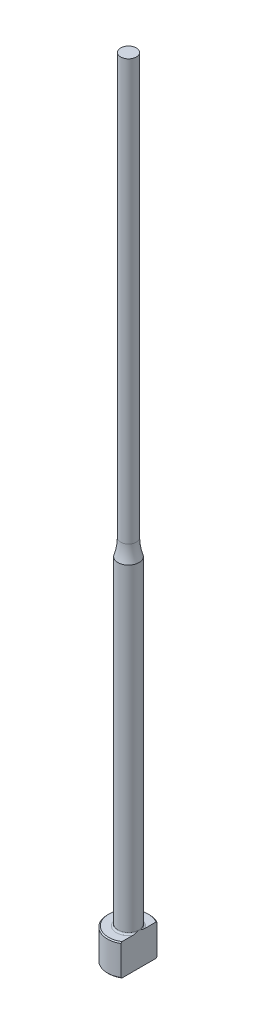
ISO-10303-21;
HEADER;
FILE_DESCRIPTION(('STEP AP214'),'2;1');
FILE_NAME('part.step','',(''),(''),'','','');
FILE_SCHEMA(('AUTOMOTIVE_DESIGN { 1 0 10303 214 1 1 1 1 }'));
ENDSEC;
DATA;
#1=APPLICATION_CONTEXT('core data for automotive mechanical design processes');
#2=APPLICATION_PROTOCOL_DEFINITION('international standard','automotive_design',2000,#1);
#3=PRODUCT_CONTEXT('',#1,'mechanical');
#4=PRODUCT('Part','Part','',(#3));
#5=PRODUCT_RELATED_PRODUCT_CATEGORY('part','',(#4));
#6=PRODUCT_DEFINITION_FORMATION('','',#4);
#7=PRODUCT_DEFINITION_CONTEXT('part definition',#1,'design');
#8=PRODUCT_DEFINITION('design','',#6,#7);
#9=PRODUCT_DEFINITION_SHAPE('','',#8);
#10=(LENGTH_UNIT() NAMED_UNIT(*) SI_UNIT(.MILLI.,.METRE.));
#11=(NAMED_UNIT(*) PLANE_ANGLE_UNIT() SI_UNIT($,.RADIAN.));
#12=(NAMED_UNIT(*) SI_UNIT($,.STERADIAN.) SOLID_ANGLE_UNIT());
#13=UNCERTAINTY_MEASURE_WITH_UNIT(LENGTH_MEASURE(1.E-05),#10,'distance_accuracy_value','');
#14=(GEOMETRIC_REPRESENTATION_CONTEXT(3) GLOBAL_UNCERTAINTY_ASSIGNED_CONTEXT((#13)) GLOBAL_UNIT_ASSIGNED_CONTEXT((#10,
#11,#12)) REPRESENTATION_CONTEXT('',''));
#15=CARTESIAN_POINT('',(0.,0.,0.));
#16=DIRECTION('',(0.,0.,1.));
#17=DIRECTION('',(1.,0.,0.));
#18=AXIS2_PLACEMENT_3D('',#15,#16,#17);
#19=CARTESIAN_POINT('',(-3.99999999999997,6.,0.));
#20=DIRECTION('',(0.,1.,0.));
#21=DIRECTION('',(0.,0.,1.));
#22=AXIS2_PLACEMENT_3D('',#19,#20,#21);
#23=PLANE('',#22);
#24=CARTESIAN_POINT('',(0.,6.,0.));
#25=DIRECTION('',(0.,1.,0.));
#26=DIRECTION('',(0.,0.,1.));
#27=AXIS2_PLACEMENT_3D('',#24,#25,#26);
#28=CIRCLE('',#27,3.79999999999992);
#29=CARTESIAN_POINT('',(1.99999999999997,6.,-3.23109888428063));
#30=VERTEX_POINT('',#29);
#31=CARTESIAN_POINT('',(1.99999999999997,6.,3.23109888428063));
#32=VERTEX_POINT('',#31);
#33=EDGE_CURVE('E187',#30,#32,#28,.T.);
#34=ORIENTED_EDGE('',*,*,#33,.T.);
#35=DIRECTION('',(0.,0.,-1.));
#36=VECTOR('',#35,1.);
#37=CARTESIAN_POINT('',(1.99999999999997,6.,0.));
#38=LINE('',#37,#36);
#39=CARTESIAN_POINT('',(1.99999999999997,5.99999999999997,1.13578166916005));
#40=VERTEX_POINT('',#39);
#41=EDGE_CURVE('E57',#32,#40,#38,.T.);
#42=ORIENTED_EDGE('',*,*,#41,.T.);
#43=CARTESIAN_POINT('',(0.,6.,0.));
#44=DIRECTION('',(0.,1.,0.));
#45=DIRECTION('',(0.,0.,1.));
#46=AXIS2_PLACEMENT_3D('',#43,#44,#45);
#47=CIRCLE('',#46,2.29999999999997);
#48=CARTESIAN_POINT('',(1.99999999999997,5.99999999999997,-1.13578166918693));
#49=VERTEX_POINT('',#48);
#50=EDGE_CURVE('E108',#40,#49,#47,.F.);
#51=ORIENTED_EDGE('',*,*,#50,.T.);
#52=EDGE_CURVE('E137',#49,#30,#38,.T.);
#53=ORIENTED_EDGE('',*,*,#52,.T.);
#54=EDGE_LOOP('',(#34,#42,#51,#53));
#55=FACE_BOUND('',#54,.T.);
#56=ADVANCED_FACE('F32',(#55),#23,.T.);
#57=CARTESIAN_POINT('',(0.,259.958771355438,0.));
#58=DIRECTION('',(0.,1.,0.));
#59=DIRECTION('',(0.,0.,1.));
#60=AXIS2_PLACEMENT_3D('',#57,#58,#59);
#61=CYLINDRICAL_SURFACE('',#60,3.99999999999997);
#62=CARTESIAN_POINT('',(0.,5.79999999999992,0.));
#63=DIRECTION('',(0.,1.,0.));
#64=DIRECTION('',(0.,0.,1.));
#65=AXIS2_PLACEMENT_3D('',#62,#63,#64);
#66=CIRCLE('',#65,3.99999999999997);
#67=CARTESIAN_POINT('',(1.99999999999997,5.79999999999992,3.46410161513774));
#68=VERTEX_POINT('',#67);
#69=CARTESIAN_POINT('',(1.99999999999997,5.79999999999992,-3.46410161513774));
#70=VERTEX_POINT('',#69);
#71=EDGE_CURVE('E105',#68,#70,#66,.F.);
#72=ORIENTED_EDGE('',*,*,#71,.T.);
#73=DIRECTION('',(0.,-1.,0.));
#74=VECTOR('',#73,1.);
#75=CARTESIAN_POINT('',(1.99999999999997,150.,-3.46410161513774));
#76=LINE('',#75,#74);
#77=CARTESIAN_POINT('',(1.99999999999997,0.199999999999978,-3.46410161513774));
#78=VERTEX_POINT('',#77);
#79=EDGE_CURVE('E193',#70,#78,#76,.T.);
#80=ORIENTED_EDGE('',*,*,#79,.T.);
#81=CARTESIAN_POINT('',(0.,0.199999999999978,0.));
#82=DIRECTION('',(0.,-1.,0.));
#83=DIRECTION('',(0.,0.,-1.));
#84=AXIS2_PLACEMENT_3D('',#81,#82,#83);
#85=CIRCLE('',#84,3.99999999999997);
#86=CARTESIAN_POINT('',(1.99999999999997,0.199999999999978,3.46410161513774));
#87=VERTEX_POINT('',#86);
#88=EDGE_CURVE('E100',#78,#87,#85,.F.);
#89=ORIENTED_EDGE('',*,*,#88,.T.);
#90=DIRECTION('',(0.,-1.,0.));
#91=VECTOR('',#90,1.);
#92=CARTESIAN_POINT('',(1.99999999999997,150.,3.46410161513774));
#93=LINE('',#92,#91);
#94=EDGE_CURVE('E93',#68,#87,#93,.T.);
#95=ORIENTED_EDGE('',*,*,#94,.F.);
#96=EDGE_LOOP('',(#72,#80,#89,#95));
#97=FACE_BOUND('',#96,.T.);
#98=ADVANCED_FACE('F158',(#97),#61,.T.);
#99=CARTESIAN_POINT('',(0.,0.,0.));
#100=DIRECTION('',(0.,-1.,0.));
#101=DIRECTION('',(0.,0.,-1.));
#102=AXIS2_PLACEMENT_3D('',#99,#100,#101);
#103=PLANE('',#102);
#104=CARTESIAN_POINT('',(0.,0.,0.));
#105=DIRECTION('',(0.,-1.,0.));
#106=DIRECTION('',(0.,0.,-1.));
#107=AXIS2_PLACEMENT_3D('',#104,#105,#106);
#108=CIRCLE('',#107,3.79999999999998);
#109=CARTESIAN_POINT('',(1.99999999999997,0.,3.2310988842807));
#110=VERTEX_POINT('',#109);
#111=CARTESIAN_POINT('',(1.99999999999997,0.,-3.2310988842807));
#112=VERTEX_POINT('',#111);
#113=EDGE_CURVE('E98',#110,#112,#108,.T.);
#114=ORIENTED_EDGE('',*,*,#113,.T.);
#115=DIRECTION('',(0.,0.,1.));
#116=VECTOR('',#115,1.);
#117=CARTESIAN_POINT('',(1.99999999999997,0.,3.46410161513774));
#118=LINE('',#117,#116);
#119=EDGE_CURVE('E83',#112,#110,#118,.T.);
#120=ORIENTED_EDGE('',*,*,#119,.T.);
#121=EDGE_LOOP('',(#114,#120));
#122=FACE_BOUND('',#121,.T.);
#123=ADVANCED_FACE('F103',(#122),#103,.T.);
#124=CARTESIAN_POINT('',(0.,6.00000000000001,0.));
#125=DIRECTION('',(0.,-1.,0.));
#126=DIRECTION('',(0.,0.,-1.));
#127=AXIS2_PLACEMENT_3D('',#124,#125,#126);
#128=CONICAL_SURFACE('',#127,3.79999999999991,0.785398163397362);
#129=ORIENTED_EDGE('',*,*,#71,.F.);
#130=CARTESIAN_POINT('',(1.99999999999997,1.91904532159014,7.62295524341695));
#131=CARTESIAN_POINT('',(1.99999999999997,2.08611243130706,7.4502239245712));
#132=CARTESIAN_POINT('',(1.99999999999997,2.25300024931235,7.27731861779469));
#133=CARTESIAN_POINT('',(1.99999999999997,2.58631125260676,6.93105655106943));
#134=CARTESIAN_POINT('',(1.99999999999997,2.75273443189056,6.75769978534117));
#135=CARTESIAN_POINT('',(1.99999999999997,3.08509080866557,6.41034692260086));
#136=CARTESIAN_POINT('',(1.99999999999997,3.25102371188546,6.23635054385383));
#137=CARTESIAN_POINT('',(1.99999999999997,3.5821559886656,5.88766284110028));
#138=CARTESIAN_POINT('',(1.99999999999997,3.74735536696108,5.71297152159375));
#139=CARTESIAN_POINT('',(1.99999999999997,4.07353855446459,5.36616839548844));
#140=CARTESIAN_POINT('',(1.99999999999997,4.23454099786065,5.19407412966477));
#141=CARTESIAN_POINT('',(1.99999999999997,4.55534102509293,4.84876663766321));
#142=CARTESIAN_POINT('',(1.99999999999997,4.71513861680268,4.67555341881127));
#143=CARTESIAN_POINT('',(1.99999999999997,5.03306183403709,4.32766569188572));
#144=CARTESIAN_POINT('',(1.99999999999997,5.1911878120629,4.15299150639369));
#145=CARTESIAN_POINT('',(1.99999999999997,5.50513944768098,3.80159134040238));
#146=CARTESIAN_POINT('',(1.99999999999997,5.66096519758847,3.62486544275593));
#147=CARTESIAN_POINT('',(1.99999999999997,5.90974646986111,3.33722425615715));
#148=CARTESIAN_POINT('',(1.99999999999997,6.00376148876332,3.22722645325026));
#149=CARTESIAN_POINT('',(1.99999999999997,6.19011825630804,3.00579987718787));
#150=CARTESIAN_POINT('',(1.99999999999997,6.28245983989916,2.89437096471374));
#151=CARTESIAN_POINT('',(1.99999999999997,6.46586188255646,2.66849662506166));
#152=CARTESIAN_POINT('',(1.99999999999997,6.55689849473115,2.5540317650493));
#153=CARTESIAN_POINT('',(1.99999999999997,6.73578809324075,2.32266819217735));
#154=CARTESIAN_POINT('',(1.99999999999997,6.82364184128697,2.20577007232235));
#155=CARTESIAN_POINT('',(1.99999999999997,6.99612756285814,1.96688707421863));
#156=CARTESIAN_POINT('',(1.99999999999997,7.08069035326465,1.84485190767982));
#157=CARTESIAN_POINT('',(1.99999999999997,7.2430026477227,1.59599329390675));
#158=CARTESIAN_POINT('',(1.99999999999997,7.32074277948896,1.46916359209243));
#159=CARTESIAN_POINT('',(1.99999999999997,7.42869763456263,1.27510066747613));
#160=CARTESIAN_POINT('',(1.99999999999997,7.46305374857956,1.21018943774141));
#161=CARTESIAN_POINT('',(1.99999999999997,7.52837146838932,1.07868835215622));
#162=CARTESIAN_POINT('',(1.99999999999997,7.5593324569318,1.01209819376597));
#163=CARTESIAN_POINT('',(1.99999999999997,7.64566860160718,0.809894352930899));
#164=CARTESIAN_POINT('',(1.99999999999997,7.69478214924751,0.671360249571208));
#165=CARTESIAN_POINT('',(1.99999999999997,7.7479482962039,0.463657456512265));
#166=CARTESIAN_POINT('',(1.99999999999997,7.76205065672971,0.397033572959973));
#167=CARTESIAN_POINT('',(1.99999999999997,7.78390371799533,0.262728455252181));
#168=CARTESIAN_POINT('',(1.99999999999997,7.79165498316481,0.19504731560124));
#169=CARTESIAN_POINT('',(1.99999999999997,7.80025690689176,0.0594528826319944));
#170=CARTESIAN_POINT('',(1.99999999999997,7.80112894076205,-0.00845903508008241));
#171=CARTESIAN_POINT('',(1.99999999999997,7.79596585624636,-0.144020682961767));
#172=CARTESIAN_POINT('',(1.99999999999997,7.78993016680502,-0.211670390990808));
#173=CARTESIAN_POINT('',(1.99999999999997,7.77145363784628,-0.345483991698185));
#174=CARTESIAN_POINT('',(1.99999999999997,7.75906777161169,-0.411655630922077));
#175=CARTESIAN_POINT('',(1.99999999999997,7.72866360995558,-0.542678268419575));
#176=CARTESIAN_POINT('',(1.99999999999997,7.71064463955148,-0.607529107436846));
#177=CARTESIAN_POINT('',(1.99999999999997,7.66972939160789,-0.736064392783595));
#178=CARTESIAN_POINT('',(1.99999999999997,7.64680564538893,-0.799739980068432));
#179=CARTESIAN_POINT('',(1.99999999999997,7.5970014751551,-0.925489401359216));
#180=CARTESIAN_POINT('',(1.99999999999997,7.57012185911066,-0.987563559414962));
#181=CARTESIAN_POINT('',(1.99999999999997,7.48443518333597,-1.17209020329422));
#182=CARTESIAN_POINT('',(1.99999999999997,7.42077407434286,-1.29228210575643));
#183=CARTESIAN_POINT('',(1.99999999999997,7.28502644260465,-1.52785770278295));
#184=CARTESIAN_POINT('',(1.99999999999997,7.21292931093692,-1.6432350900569));
#185=CARTESIAN_POINT('',(1.99999999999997,7.06281517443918,-1.8706938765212));
#186=CARTESIAN_POINT('',(1.99999999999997,6.98477595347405,-1.98276048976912));
#187=CARTESIAN_POINT('',(1.99999999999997,6.82481971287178,-2.20397837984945));
#188=CARTESIAN_POINT('',(1.99999999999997,6.74290465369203,-2.31313108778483));
#189=CARTESIAN_POINT('',(1.99999999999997,6.5751722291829,-2.5306854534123));
#190=CARTESIAN_POINT('',(1.99999999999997,6.48931769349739,-2.63905831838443));
#191=CARTESIAN_POINT('',(1.99999999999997,6.31548151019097,-2.85409686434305));
#192=CARTESIAN_POINT('',(1.99999999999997,6.22749963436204,-2.96076236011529));
#193=CARTESIAN_POINT('',(1.99999999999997,6.0501503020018,-3.17249211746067));
#194=CARTESIAN_POINT('',(1.99999999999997,5.96078672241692,-3.27755963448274));
#195=CARTESIAN_POINT('',(1.99999999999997,5.78082366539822,-3.48663191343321));
#196=CARTESIAN_POINT('',(1.99999999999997,5.69022416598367,-3.59063665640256));
#197=CARTESIAN_POINT('',(1.99999999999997,5.44796733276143,-3.86612439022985));
#198=CARTESIAN_POINT('',(1.99999999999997,5.29545972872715,-4.03685912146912));
#199=CARTESIAN_POINT('',(1.99999999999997,4.98858070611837,-4.37664803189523));
#200=CARTESIAN_POINT('',(1.99999999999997,4.834209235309,-4.54570216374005));
#201=CARTESIAN_POINT('',(1.99999999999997,4.52396102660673,-4.88271638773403));
#202=CARTESIAN_POINT('',(1.99999999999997,4.36808300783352,-5.05067529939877));
#203=CARTESIAN_POINT('',(1.99999999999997,4.05530513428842,-5.38563883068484));
#204=CARTESIAN_POINT('',(1.99999999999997,3.89840527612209,-5.55264344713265));
#205=CARTESIAN_POINT('',(1.99999999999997,3.59029018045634,-5.87905385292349));
#206=CARTESIAN_POINT('',(1.99999999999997,3.43910664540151,-6.03848959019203));
#207=CARTESIAN_POINT('',(1.99999999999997,3.13616436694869,-6.35681456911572));
#208=CARTESIAN_POINT('',(1.99999999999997,2.98440562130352,-6.5157038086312));
#209=CARTESIAN_POINT('',(1.99999999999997,2.68059501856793,-6.83286192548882));
#210=CARTESIAN_POINT('',(1.99999999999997,2.5285436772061,-6.99113129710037));
#211=CARTESIAN_POINT('',(1.99999999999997,2.22406035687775,-7.30730102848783));
#212=CARTESIAN_POINT('',(1.99999999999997,2.07162838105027,-7.46520139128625));
#213=CARTESIAN_POINT('',(1.99999999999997,1.91904532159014,-7.62295524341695));
#214=B_SPLINE_CURVE_WITH_KNOTS('',3,(#130,#131,#132,#133,#134,#135,#136,#137,#138,#139,#140,
#141,#142,#143,#144,#145,#146,#147,#148,#149,#150,#151,#152,#153,#154,#155,#156,#157,#158,#159,
#160,#161,#162,#163,#164,#165,#166,#167,#168,#169,#170,#171,#172,#173,#174,#175,#176,#177,#178,
#179,#180,#181,#182,#183,#184,#185,#186,#187,#188,#189,#190,#191,#192,#193,#194,#195,#196,#197,
#198,#199,#200,#201,#202,#203,#204,#205,#206,#207,#208,#209,#210,#211,#212,#213),.UNSPECIFIED.,
.F.,.F.,(4,2,2,2,2,2,2,2,2,2,2,2,2,2,2,2,2,2,2,2,2,2,2,2,2,2,2,2,2,2,2,2,2,2,2,2,2,2,2,2,2,4),
(0.,0.720921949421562,1.4418531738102,2.16315326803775,2.8844486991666,3.59144103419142,
4.29842874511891,5.00526427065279,5.7120713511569,6.14616174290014,6.58029471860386,
7.01901494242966,7.45762947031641,7.90290456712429,8.34878206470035,8.56901415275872,
8.78928621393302,9.228144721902,9.43219512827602,9.63622739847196,9.83962544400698,
10.0430403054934,10.244723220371,10.4464303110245,10.6492980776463,10.8521244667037,
11.2595582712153,11.6675100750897,12.0770700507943,12.4864250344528,12.9011677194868,
13.3159550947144,13.7297367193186,14.1435257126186,14.8302935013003,15.5170805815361,
16.2045145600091,16.891950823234,17.5511045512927,18.2102608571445,18.8686819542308,
19.5270976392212),.UNSPECIFIED.);
#215=EDGE_CURVE('E136',#68,#32,#214,.T.);
#216=ORIENTED_EDGE('',*,*,#215,.T.);
#217=ORIENTED_EDGE('',*,*,#33,.F.);
#218=EDGE_CURVE('E128',#30,#70,#214,.T.);
#219=ORIENTED_EDGE('',*,*,#218,.T.);
#220=EDGE_LOOP('',(#129,#216,#217,#219));
#221=FACE_BOUND('',#220,.T.);
#222=ADVANCED_FACE('F144',(#221),#128,.T.);
#223=CARTESIAN_POINT('',(0.,0.199999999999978,0.));
#224=DIRECTION('',(0.,1.,0.));
#225=DIRECTION('',(0.,0.,1.));
#226=AXIS2_PLACEMENT_3D('',#223,#224,#225);
#227=CONICAL_SURFACE('',#226,3.99999999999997,0.785398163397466);
#228=ORIENTED_EDGE('',*,*,#88,.F.);
#229=CARTESIAN_POINT('',(1.99999999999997,4.08095467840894,-7.62295524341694));
#230=CARTESIAN_POINT('',(1.99999999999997,3.91388756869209,-7.45022392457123));
#231=CARTESIAN_POINT('',(1.99999999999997,3.74699975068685,-7.27731861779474));
#232=CARTESIAN_POINT('',(1.99999999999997,3.41368874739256,-6.93105655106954));
#233=CARTESIAN_POINT('',(1.99999999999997,3.24726556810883,-6.7576997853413));
#234=CARTESIAN_POINT('',(1.99999999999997,2.91490919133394,-6.41034692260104));
#235=CARTESIAN_POINT('',(1.99999999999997,2.7489762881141,-6.23635054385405));
#236=CARTESIAN_POINT('',(1.99999999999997,2.41784401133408,-5.88766284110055));
#237=CARTESIAN_POINT('',(1.99999999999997,2.25264463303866,-5.71297152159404));
#238=CARTESIAN_POINT('',(1.99999999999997,1.92646144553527,-5.36616839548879));
#239=CARTESIAN_POINT('',(1.99999999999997,1.76545900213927,-5.19407412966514));
#240=CARTESIAN_POINT('',(1.99999999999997,1.44465897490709,-4.84876663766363));
#241=CARTESIAN_POINT('',(1.99999999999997,1.28486138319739,-4.67555341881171));
#242=CARTESIAN_POINT('',(1.99999999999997,0.966938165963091,-4.32766569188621));
#243=CARTESIAN_POINT('',(1.99999999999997,0.808812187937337,-4.1529915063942));
#244=CARTESIAN_POINT('',(1.99999999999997,0.494860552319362,-3.80159134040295));
#245=CARTESIAN_POINT('',(1.99999999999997,0.339034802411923,-3.62486544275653));
#246=CARTESIAN_POINT('',(1.99999999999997,0.0902535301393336,-3.33722425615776));
#247=CARTESIAN_POINT('',(1.99999999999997,-0.0037614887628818,-3.22722645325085));
#248=CARTESIAN_POINT('',(1.99999999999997,-0.190118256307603,-3.00579987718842));
#249=CARTESIAN_POINT('',(1.99999999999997,-0.282459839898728,-2.89437096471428));
#250=CARTESIAN_POINT('',(1.99999999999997,-0.465861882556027,-2.66849662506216));
#251=CARTESIAN_POINT('',(1.99999999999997,-0.556898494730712,-2.55403176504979));
#252=CARTESIAN_POINT('',(1.99999999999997,-0.735788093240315,-2.3226681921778));
#253=CARTESIAN_POINT('',(1.99999999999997,-0.823641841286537,-2.20577007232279));
#254=CARTESIAN_POINT('',(1.99999999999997,-0.996127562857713,-1.96688707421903));
#255=CARTESIAN_POINT('',(1.99999999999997,-1.08069035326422,-1.84485190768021));
#256=CARTESIAN_POINT('',(1.99999999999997,-1.24300264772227,-1.59599329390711));
#257=CARTESIAN_POINT('',(1.99999999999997,-1.32074277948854,-1.46916359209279));
#258=CARTESIAN_POINT('',(1.99999999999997,-1.42869763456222,-1.27510066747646));
#259=CARTESIAN_POINT('',(1.99999999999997,-1.46305374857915,-1.21018943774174));
#260=CARTESIAN_POINT('',(1.99999999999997,-1.52837146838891,-1.07868835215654));
#261=CARTESIAN_POINT('',(1.99999999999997,-1.5593324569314,-1.01209819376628));
#262=CARTESIAN_POINT('',(1.99999999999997,-1.64566860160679,-0.809894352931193));
#263=CARTESIAN_POINT('',(1.99999999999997,-1.69478214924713,-0.671360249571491));
#264=CARTESIAN_POINT('',(1.99999999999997,-1.74794829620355,-0.46365745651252));
#265=CARTESIAN_POINT('',(1.99999999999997,-1.76205065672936,-0.39703357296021));
#266=CARTESIAN_POINT('',(1.99999999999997,-1.783903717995,-0.26272845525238));
#267=CARTESIAN_POINT('',(1.99999999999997,-1.79165498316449,-0.195047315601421));
#268=CARTESIAN_POINT('',(1.99999999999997,-1.80025690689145,-0.0594528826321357));
#269=CARTESIAN_POINT('',(1.99999999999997,-1.80112894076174,0.00845903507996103));
#270=CARTESIAN_POINT('',(1.99999999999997,-1.79596585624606,0.144020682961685));
#271=CARTESIAN_POINT('',(1.99999999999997,-1.78993016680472,0.211670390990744));
#272=CARTESIAN_POINT('',(1.99999999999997,-1.77145363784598,0.345483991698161));
#273=CARTESIAN_POINT('',(1.99999999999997,-1.75906777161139,0.411655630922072));
#274=CARTESIAN_POINT('',(1.99999999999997,-1.72866360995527,0.542678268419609));
#275=CARTESIAN_POINT('',(1.99999999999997,-1.71064463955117,0.607529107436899));
#276=CARTESIAN_POINT('',(1.99999999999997,-1.66972939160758,0.736064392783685));
#277=CARTESIAN_POINT('',(1.99999999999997,-1.64680564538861,0.799739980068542));
#278=CARTESIAN_POINT('',(1.99999999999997,-1.59700147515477,0.925489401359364));
#279=CARTESIAN_POINT('',(1.99999999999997,-1.57012185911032,0.987563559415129));
#280=CARTESIAN_POINT('',(1.99999999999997,-1.4844351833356,1.17209020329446));
#281=CARTESIAN_POINT('',(1.99999999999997,-1.42077407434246,1.29228210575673));
#282=CARTESIAN_POINT('',(1.99999999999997,-1.2850264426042,1.52785770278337));
#283=CARTESIAN_POINT('',(1.99999999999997,-1.21292931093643,1.64323509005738));
#284=CARTESIAN_POINT('',(1.99999999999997,-1.06281517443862,1.87069387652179));
#285=CARTESIAN_POINT('',(1.99999999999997,-0.984775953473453,1.98276048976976));
#286=CARTESIAN_POINT('',(1.99999999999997,-0.824819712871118,2.2039783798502));
#287=CARTESIAN_POINT('',(1.99999999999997,-0.742904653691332,2.31313108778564));
#288=CARTESIAN_POINT('',(1.99999999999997,-0.575172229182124,2.53068545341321));
#289=CARTESIAN_POINT('',(1.99999999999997,-0.489317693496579,2.6390583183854));
#290=CARTESIAN_POINT('',(1.99999999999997,-0.315481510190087,2.85409686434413));
#291=CARTESIAN_POINT('',(1.99999999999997,-0.227499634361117,2.96076236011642));
#292=CARTESIAN_POINT('',(1.99999999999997,-0.0501503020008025,3.17249211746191));
#293=CARTESIAN_POINT('',(1.99999999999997,0.039213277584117,3.27755963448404));
#294=CARTESIAN_POINT('',(1.99999999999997,0.219176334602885,3.48663191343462));
#295=CARTESIAN_POINT('',(1.99999999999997,0.309775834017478,3.59063665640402));
#296=CARTESIAN_POINT('',(1.99999999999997,0.552032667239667,3.86612439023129));
#297=CARTESIAN_POINT('',(1.99999999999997,0.704540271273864,4.03685912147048));
#298=CARTESIAN_POINT('',(1.99999999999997,1.01141929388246,4.37664803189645));
#299=CARTESIAN_POINT('',(1.99999999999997,1.16579076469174,4.54570216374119));
#300=CARTESIAN_POINT('',(1.99999999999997,1.47603897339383,4.88271638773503));
#301=CARTESIAN_POINT('',(1.99999999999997,1.63191699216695,5.0506752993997));
#302=CARTESIAN_POINT('',(1.99999999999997,1.94469486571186,5.38563883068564));
#303=CARTESIAN_POINT('',(1.99999999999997,2.10159472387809,5.55264344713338));
#304=CARTESIAN_POINT('',(1.99999999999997,2.40970981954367,5.87905385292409));
#305=CARTESIAN_POINT('',(1.99999999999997,2.56089335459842,6.03848959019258));
#306=CARTESIAN_POINT('',(1.99999999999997,2.86383563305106,6.35681456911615));
#307=CARTESIAN_POINT('',(1.99999999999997,3.01559437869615,6.51570380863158));
#308=CARTESIAN_POINT('',(1.99999999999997,3.31940498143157,6.83286192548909));
#309=CARTESIAN_POINT('',(1.99999999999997,3.47145632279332,6.99113129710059));
#310=CARTESIAN_POINT('',(1.99999999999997,3.77593964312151,7.30730102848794));
#311=CARTESIAN_POINT('',(1.99999999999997,3.9283716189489,7.4652013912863));
#312=CARTESIAN_POINT('',(1.99999999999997,4.08095467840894,7.62295524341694));
#313=B_SPLINE_CURVE_WITH_KNOTS('',3,(#229,#230,#231,#232,#233,#234,#235,#236,#237,#238,#239,
#240,#241,#242,#243,#244,#245,#246,#247,#248,#249,#250,#251,#252,#253,#254,#255,#256,#257,#258,
#259,#260,#261,#262,#263,#264,#265,#266,#267,#268,#269,#270,#271,#272,#273,#274,#275,#276,#277,
#278,#279,#280,#281,#282,#283,#284,#285,#286,#287,#288,#289,#290,#291,#292,#293,#294,#295,#296,
#297,#298,#299,#300,#301,#302,#303,#304,#305,#306,#307,#308,#309,#310,#311,#312),.UNSPECIFIED.,
.F.,.F.,(4,2,2,2,2,2,2,2,2,2,2,2,2,2,2,2,2,2,2,2,2,2,2,2,2,2,2,2,2,2,2,2,2,2,2,2,2,2,2,2,2,4),
(0.,0.720921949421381,1.44185317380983,2.1631532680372,2.88444869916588,3.59144103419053,
4.29842874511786,5.00526427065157,5.71207135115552,6.1461617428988,6.58029471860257,
7.0190149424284,7.4576294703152,7.90290456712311,8.34878206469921,8.56901415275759,
8.78928621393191,9.22814472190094,9.43219512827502,9.63622739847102,9.83962544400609,
10.0430403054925,10.2447232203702,10.4464303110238,10.6492980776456,10.8521244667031,
11.2595582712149,11.6675100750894,12.0770700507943,12.486425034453,12.9011677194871,
13.3159550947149,13.7297367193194,14.1435257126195,14.8302935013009,15.5170805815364,
16.2045145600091,16.8919508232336,17.551104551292,18.2102608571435,18.8686819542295,
19.5270976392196),.UNSPECIFIED.);
#314=EDGE_CURVE('E86',#78,#112,#313,.T.);
#315=ORIENTED_EDGE('',*,*,#314,.T.);
#316=ORIENTED_EDGE('',*,*,#113,.F.);
#317=EDGE_CURVE('E89',#110,#87,#313,.T.);
#318=ORIENTED_EDGE('',*,*,#317,.T.);
#319=EDGE_LOOP('',(#228,#315,#316,#318));
#320=FACE_BOUND('',#319,.T.);
#321=ADVANCED_FACE('F97',(#320),#227,.T.);
#322=CARTESIAN_POINT('',(0.,6.29999999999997,0.));
#323=DIRECTION('',(0.,1.,0.));
#324=DIRECTION('',(0.,0.,1.));
#325=AXIS2_PLACEMENT_3D('',#322,#323,#324);
#326=TOROIDAL_SURFACE('',#325,2.29999999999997,0.3);
#327=CARTESIAN_POINT('',(1.99999999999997,6.29999999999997,0.));
#328=CARTESIAN_POINT('',(1.99999999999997,6.30000062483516,-7.91120119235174E-11));
#329=CARTESIAN_POINT('',(1.99999999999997,6.3000012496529,-1.38466953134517E-07));
#330=CARTESIAN_POINT('',(1.99999999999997,6.3000024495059,-5.72507056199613E-07));
#331=CARTESIAN_POINT('',(1.99999999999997,6.30000302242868,-8.72848936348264E-07));
#332=CARTESIAN_POINT('',(1.99999999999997,6.30000416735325,-1.59335938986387E-06));
#333=CARTESIAN_POINT('',(1.99999999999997,6.30000473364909,-2.02244692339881E-06));
#334=CARTESIAN_POINT('',(1.99999999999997,6.30000579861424,-2.94494844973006E-06));
#335=CARTESIAN_POINT('',(1.99999999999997,6.30000629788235,-3.4377030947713E-06));
#336=CARTESIAN_POINT('',(1.99999999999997,6.30000798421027,-5.21460072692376E-06));
#337=CARTESIAN_POINT('',(1.99999999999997,6.30000908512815,-6.58180911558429E-06));
#338=CARTESIAN_POINT('',(1.99999999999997,6.30001103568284,-9.3977532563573E-06));
#339=CARTESIAN_POINT('',(1.99999999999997,6.30001189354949,-1.08411101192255E-05));
#340=CARTESIAN_POINT('',(1.99999999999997,6.30001514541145,-1.65122775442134E-05));
#341=CARTESIAN_POINT('',(1.99999999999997,6.30001737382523,-2.08398783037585E-05));
#342=CARTESIAN_POINT('',(1.99999999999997,6.30002099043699,-2.93440763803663E-05));
#343=CARTESIAN_POINT('',(1.99999999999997,6.30002243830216,-3.34960297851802E-05));
#344=CARTESIAN_POINT('',(1.99999999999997,6.30002863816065,-5.12890573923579E-05));
#345=CARTESIAN_POINT('',(1.99999999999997,6.30003337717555,-6.49250938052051E-05));
#346=CARTESIAN_POINT('',(1.99999999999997,6.30004093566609,-9.03829827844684E-05));
#347=CARTESIAN_POINT('',(1.99999999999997,6.30004394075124,-0.000102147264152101));
#348=CARTESIAN_POINT('',(1.99999999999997,6.30006787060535,-0.000188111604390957));
#349=CARTESIAN_POINT('',(1.99999999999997,6.3000985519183,-0.000259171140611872));
#350=CARTESIAN_POINT('',(1.99999999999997,6.30021378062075,-0.00053614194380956));
#351=CARTESIAN_POINT('',(1.99999999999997,6.3002910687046,-0.000744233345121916));
#352=CARTESIAN_POINT('',(1.99999999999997,6.30059644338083,-0.00155446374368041));
#353=CARTESIAN_POINT('',(1.99999999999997,6.30083214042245,-0.00215436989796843));
#354=CARTESIAN_POINT('',(1.99999999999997,6.30179425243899,-0.00461477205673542));
#355=CARTESIAN_POINT('',(1.99999999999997,6.30251207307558,-0.00647773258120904));
#356=CARTESIAN_POINT('',(1.99999999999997,6.31311632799,-0.0339840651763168));
#357=CARTESIAN_POINT('',(1.99999999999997,6.32306890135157,-0.0596088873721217));
#358=CARTESIAN_POINT('',(1.99999999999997,6.34248629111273,-0.109946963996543));
#359=CARTESIAN_POINT('',(1.99999999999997,6.35195547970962,-0.134658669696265));
#360=CARTESIAN_POINT('',(1.99999999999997,6.37186796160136,-0.18704653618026));
#361=CARTESIAN_POINT('',(1.99999999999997,6.38229466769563,-0.214729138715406));
#362=CARTESIAN_POINT('',(1.99999999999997,6.40297705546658,-0.270480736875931));
#363=CARTESIAN_POINT('',(1.99999999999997,6.41322989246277,-0.298550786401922));
#364=CARTESIAN_POINT('',(1.99999999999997,6.43806738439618,-0.36800773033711));
#365=CARTESIAN_POINT('',(1.99999999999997,6.45243182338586,-0.409474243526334));
#366=CARTESIAN_POINT('',(1.99999999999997,6.47965482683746,-0.491807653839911));
#367=CARTESIAN_POINT('',(1.99999999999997,6.49254110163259,-0.532665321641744));
#368=CARTESIAN_POINT('',(1.99999999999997,6.51851192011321,-0.620554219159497));
#369=CARTESIAN_POINT('',(1.99999999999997,6.53137383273,-0.667652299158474));
#370=CARTESIAN_POINT('',(1.99999999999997,6.55459547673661,-0.762854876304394));
#371=CARTESIAN_POINT('',(1.99999999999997,6.5649353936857,-0.810964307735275));
#372=CARTESIAN_POINT('',(1.99999999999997,6.58270957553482,-0.910933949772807));
#373=CARTESIAN_POINT('',(1.99999999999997,6.58991426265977,-0.962836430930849));
#374=CARTESIAN_POINT('',(1.99999999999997,6.59906919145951,-1.06698400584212));
#375=CARTESIAN_POINT('',(1.99999999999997,6.60103790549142,-1.1192272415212));
#376=CARTESIAN_POINT('',(1.99999999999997,6.59819318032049,-1.21399009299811));
#377=CARTESIAN_POINT('',(1.99999999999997,6.59455548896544,-1.2565387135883));
#378=CARTESIAN_POINT('',(1.99999999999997,6.58116512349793,-1.34017723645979));
#379=CARTESIAN_POINT('',(1.99999999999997,6.57150205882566,-1.38127935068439));
#380=CARTESIAN_POINT('',(1.99999999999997,6.55087659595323,-1.44109771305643));
#381=CARTESIAN_POINT('',(1.99999999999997,6.5429124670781,-1.46084510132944));
#382=CARTESIAN_POINT('',(1.99999999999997,6.52453399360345,-1.49924523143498));
#383=CARTESIAN_POINT('',(1.99999999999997,6.51411538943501,-1.51789599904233));
#384=CARTESIAN_POINT('',(1.99999999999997,6.49255299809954,-1.55022658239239));
#385=CARTESIAN_POINT('',(1.99999999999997,6.48185951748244,-1.56420357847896));
#386=CARTESIAN_POINT('',(1.99999999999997,6.45839348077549,-1.5902875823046));
#387=CARTESIAN_POINT('',(1.99999999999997,6.445625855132,-1.60239889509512));
#388=CARTESIAN_POINT('',(1.99999999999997,6.4218327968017,-1.62093425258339));
#389=CARTESIAN_POINT('',(1.99999999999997,6.41131183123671,-1.6280029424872));
#390=CARTESIAN_POINT('',(1.99999999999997,6.38926242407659,-1.64036132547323));
#391=CARTESIAN_POINT('',(1.99999999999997,6.37773458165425,-1.64565206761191));
#392=CARTESIAN_POINT('',(1.99999999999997,6.35379760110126,-1.65410966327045));
#393=CARTESIAN_POINT('',(1.99999999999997,6.34138166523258,-1.65725762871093));
#394=CARTESIAN_POINT('',(1.99999999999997,6.31617371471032,-1.66106000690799));
#395=CARTESIAN_POINT('',(1.99999999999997,6.3033820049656,-1.66171638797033));
#396=CARTESIAN_POINT('',(1.99999999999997,6.27959278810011,-1.66055848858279));
#397=CARTESIAN_POINT('',(1.99999999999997,6.26857876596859,-1.6590551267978));
#398=CARTESIAN_POINT('',(1.99999999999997,6.24695777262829,-1.65423593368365));
#399=CARTESIAN_POINT('',(1.99999999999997,6.23635086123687,-1.65091983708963));
#400=CARTESIAN_POINT('',(1.99999999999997,6.21566894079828,-1.64264699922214));
#401=CARTESIAN_POINT('',(1.99999999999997,6.20560117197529,-1.63767239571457));
#402=CARTESIAN_POINT('',(1.99999999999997,6.18626855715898,-1.626364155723));
#403=CARTESIAN_POINT('',(1.99999999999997,6.17700400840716,-1.62003001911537));
#404=CARTESIAN_POINT('',(1.99999999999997,6.15429988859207,-1.60233802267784));
#405=CARTESIAN_POINT('',(1.99999999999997,6.14148777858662,-1.59017362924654));
#406=CARTESIAN_POINT('',(1.99999999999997,6.11794267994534,-1.56396532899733));
#407=CARTESIAN_POINT('',(1.99999999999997,6.10721625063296,-1.54991572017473));
#408=CARTESIAN_POINT('',(1.99999999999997,6.08234423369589,-1.51253200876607));
#409=CARTESIAN_POINT('',(1.99999999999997,6.06952968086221,-1.48831711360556));
#410=CARTESIAN_POINT('',(1.99999999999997,6.04773953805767,-1.43832020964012));
#411=CARTESIAN_POINT('',(1.99999999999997,6.03876197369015,-1.41253901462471));
#412=CARTESIAN_POINT('',(1.99999999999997,6.01850750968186,-1.3410181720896));
#413=CARTESIAN_POINT('',(1.99999999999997,6.01031623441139,-1.29441496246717));
#414=CARTESIAN_POINT('',(1.99999999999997,6.00061264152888,-1.19993212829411));
#415=CARTESIAN_POINT('',(1.99999999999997,5.99920833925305,-1.15204398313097));
#416=CARTESIAN_POINT('',(1.99999999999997,6.001930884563,-1.04246961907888));
#417=CARTESIAN_POINT('',(1.99999999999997,6.00779200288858,-0.980836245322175));
#418=CARTESIAN_POINT('',(1.99999999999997,6.0256292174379,-0.858294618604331));
#419=CARTESIAN_POINT('',(1.99999999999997,6.03763032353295,-0.797390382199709));
#420=CARTESIAN_POINT('',(1.99999999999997,6.0649490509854,-0.681046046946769));
#421=CARTESIAN_POINT('',(1.99999999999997,6.07996031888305,-0.625531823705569));
#422=CARTESIAN_POINT('',(1.99999999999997,6.11250087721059,-0.515805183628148));
#423=CARTESIAN_POINT('',(1.99999999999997,6.13000629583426,-0.461585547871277));
#424=CARTESIAN_POINT('',(1.99999999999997,6.15814737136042,-0.379074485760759));
#425=CARTESIAN_POINT('',(1.99999999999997,6.16814918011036,-0.350562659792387));
#426=CARTESIAN_POINT('',(1.99999999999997,6.18879761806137,-0.29295407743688));
#427=CARTESIAN_POINT('',(1.99999999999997,6.19945417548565,-0.263860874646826));
#428=CARTESIAN_POINT('',(1.99999999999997,6.21767622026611,-0.214869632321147));
#429=CARTESIAN_POINT('',(1.99999999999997,6.22516548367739,-0.19494302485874));
#430=CARTESIAN_POINT('',(1.99999999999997,6.24017206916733,-0.155327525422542));
#431=CARTESIAN_POINT('',(1.99999999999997,6.24768836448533,-0.135638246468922));
#432=CARTESIAN_POINT('',(1.99999999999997,6.26198776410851,-0.0983447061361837));
#433=CARTESIAN_POINT('',(1.99999999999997,6.26876515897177,-0.0807381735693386));
#434=CARTESIAN_POINT('',(1.99999999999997,6.2826325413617,-0.0448719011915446));
#435=CARTESIAN_POINT('',(1.99999999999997,6.28972459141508,-0.0266128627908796));
#436=CARTESIAN_POINT('',(1.99999999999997,6.29748742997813,-0.0064792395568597));
#437=CARTESIAN_POINT('',(1.99999999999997,6.29820461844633,-0.00461774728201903));
#438=CARTESIAN_POINT('',(1.99999999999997,6.29916656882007,-0.00215769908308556));
#439=CARTESIAN_POINT('',(1.99999999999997,6.29940270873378,-0.0015566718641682));
#440=CARTESIAN_POINT('',(1.99999999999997,6.29970861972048,-0.000745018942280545));
#441=CARTESIAN_POINT('',(1.99999999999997,6.29978601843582,-0.000536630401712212));
#442=CARTESIAN_POINT('',(1.99999999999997,6.29990139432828,-0.000259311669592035));
#443=CARTESIAN_POINT('',(1.99999999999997,6.29993209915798,-0.000188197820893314));
#444=CARTESIAN_POINT('',(1.99999999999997,6.29995604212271,-0.00010217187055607));
#445=CARTESIAN_POINT('',(1.99999999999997,6.29995904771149,-9.04035945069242E-05));
#446=CARTESIAN_POINT('',(1.99999999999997,6.29996660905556,-6.49368762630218E-05));
#447=CARTESIAN_POINT('',(1.99999999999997,6.2999713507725,-5.12961131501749E-05));
#448=CARTESIAN_POINT('',(1.99999999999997,6.29997755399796,-3.34977849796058E-05));
#449=CARTESIAN_POINT('',(1.99999999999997,6.29997900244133,-2.93452179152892E-05));
#450=CARTESIAN_POINT('',(1.99999999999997,6.29998262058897,-2.08398568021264E-05));
#451=CARTESIAN_POINT('',(1.99999999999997,6.2999848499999,-1.65117298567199E-05));
#452=CARTESIAN_POINT('',(1.99999999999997,6.29998810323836,-1.08400636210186E-05));
#453=CARTESIAN_POINT('',(1.99999999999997,6.29998896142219,-9.39665904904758E-06));
#454=CARTESIAN_POINT('',(1.99999999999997,6.29999091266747,-6.58068188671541E-06));
#455=CARTESIAN_POINT('',(1.99999999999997,6.29999201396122,-5.21349162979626E-06));
#456=CARTESIAN_POINT('',(1.99999999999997,6.29999370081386,-3.43669337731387E-06));
#457=CARTESIAN_POINT('',(1.99999999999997,6.29999420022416,-2.94398228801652E-06));
#458=CARTESIAN_POINT('',(1.99999999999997,6.29999526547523,-2.02159337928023E-06));
#459=CARTESIAN_POINT('',(1.99999999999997,6.29999583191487,-1.59257522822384E-06));
#460=CARTESIAN_POINT('',(1.99999999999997,6.29999697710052,-8.72232367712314E-07));
#461=CARTESIAN_POINT('',(1.99999999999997,6.29999755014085,-5.71985037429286E-07));
#462=CARTESIAN_POINT('',(1.99999999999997,6.29999875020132,-1.38175023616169E-07));
#463=CARTESIAN_POINT('',(1.99999999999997,6.29999937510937,7.91190278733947E-11));
#464=CARTESIAN_POINT('',(1.99999999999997,6.29999999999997,0.));
#465=B_SPLINE_CURVE_WITH_KNOTS('',3,(#327,#328,#329,#330,#331,#332,#333,#334,#335,#336,#337,
#338,#339,#340,#341,#342,#343,#344,#345,#346,#347,#348,#349,#350,#351,#352,#353,#354,#355,#356,
#357,#358,#359,#360,#361,#362,#363,#364,#365,#366,#367,#368,#369,#370,#371,#372,#373,#374,#375,
#376,#377,#378,#379,#380,#381,#382,#383,#384,#385,#386,#387,#388,#389,#390,#391,#392,#393,#394,
#395,#396,#397,#398,#399,#400,#401,#402,#403,#404,#405,#406,#407,#408,#409,#410,#411,#412,#413,
#414,#415,#416,#417,#418,#419,#420,#421,#422,#423,#424,#425,#426,#427,#428,#429,#430,#431,#432,
#433,#434,#435,#436,#437,#438,#439,#440,#441,#442,#443,#444,#445,#446,#447,#448,#449,#450,#451,
#452,#453,#454,#455,#456,#457,#458,#459,#460,#461,#462,#463,#464),.UNSPECIFIED.,.T.,.F.,(4,2,2,
2,2,2,2,2,2,2,2,2,2,2,2,2,2,2,2,2,2,2,2,2,2,2,2,2,2,2,2,2,2,2,2,2,2,2,2,2,2,2,2,2,2,2,2,2,2,2,2,
2,2,2,2,2,2,2,2,2,2,2,2,2,2,2,2,2,4),(0.,1.87392281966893E-06,3.80527467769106E-06,
5.92782295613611E-06,8.02992841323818E-06,1.32707961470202E-05,1.83039487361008E-05,
3.28629525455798E-05,4.60403129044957E-05,8.93409891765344E-05,0.000125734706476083,
0.000357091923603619,0.00102372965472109,0.00295649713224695,0.00894682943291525,
0.0914075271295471,0.170800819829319,0.259542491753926,0.349192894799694,0.480831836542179,
0.609336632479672,0.755749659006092,0.90327840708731,1.06029304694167,1.2167530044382,
1.34456674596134,1.47052354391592,1.53427785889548,1.59814364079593,1.65076980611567,
1.70327265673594,1.74115950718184,1.7790239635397,1.81721800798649,1.85538187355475,
1.88857073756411,1.92176445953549,1.95532789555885,1.98890369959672,2.04160283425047,
2.09446511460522,2.17619131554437,2.25787541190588,2.39903747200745,2.54243890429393,
2.72770087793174,2.91372355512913,3.08615579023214,3.2570365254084,3.34768022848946,
3.44062797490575,3.50449043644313,3.56771526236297,3.62431442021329,3.68307253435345,
3.68905809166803,3.69099447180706,3.69166206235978,3.69189359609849,3.69193000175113,
3.69197331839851,3.69198649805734,3.69200105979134,3.69200609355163,3.69201133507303,
3.69201343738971,3.69201556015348,3.69201749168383,3.69201936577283),.UNSPECIFIED.);
#466=CARTESIAN_POINT('',(1.99999999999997,6.29999999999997,0.));
#467=VERTEX_POINT('',#466);
#468=EDGE_CURVE('E11',#49,#467,#465,.T.);
#469=ORIENTED_EDGE('',*,*,#468,.F.);
#470=ORIENTED_EDGE('',*,*,#50,.F.);
#471=CARTESIAN_POINT('',(1.99999999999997,6.29999999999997,0.));
#472=CARTESIAN_POINT('',(1.99999999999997,6.29999937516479,7.91119678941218E-11));
#473=CARTESIAN_POINT('',(1.99999999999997,6.29999875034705,1.38466953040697E-07));
#474=CARTESIAN_POINT('',(1.99999999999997,6.29999755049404,5.72507056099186E-07));
#475=CARTESIAN_POINT('',(1.99999999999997,6.29999697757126,8.72848936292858E-07));
#476=CARTESIAN_POINT('',(1.99999999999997,6.29999583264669,1.5933593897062E-06));
#477=CARTESIAN_POINT('',(1.99999999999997,6.29999526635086,2.02244692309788E-06));
#478=CARTESIAN_POINT('',(1.99999999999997,6.29999420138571,2.94494844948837E-06));
#479=CARTESIAN_POINT('',(1.99999999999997,6.29999370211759,3.43770309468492E-06));
#480=CARTESIAN_POINT('',(1.99999999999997,6.29999201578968,5.2146007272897E-06));
#481=CARTESIAN_POINT('',(1.99999999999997,6.29999091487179,6.58180911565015E-06));
#482=CARTESIAN_POINT('',(1.99999999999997,6.29998896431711,9.39775325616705E-06));
#483=CARTESIAN_POINT('',(1.99999999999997,6.29998810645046,1.08411101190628E-05));
#484=CARTESIAN_POINT('',(1.99999999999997,6.2999848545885,1.65122775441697E-05));
#485=CARTESIAN_POINT('',(1.99999999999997,6.29998262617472,2.08398783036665E-05));
#486=CARTESIAN_POINT('',(1.99999999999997,6.29997900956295,2.93440763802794E-05));
#487=CARTESIAN_POINT('',(1.99999999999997,6.29997756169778,3.34960297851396E-05));
#488=CARTESIAN_POINT('',(1.99999999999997,6.2999713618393,5.12890573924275E-05));
#489=CARTESIAN_POINT('',(1.99999999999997,6.2999666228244,6.49250938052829E-05));
#490=CARTESIAN_POINT('',(1.99999999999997,6.29995906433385,9.03829827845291E-05));
#491=CARTESIAN_POINT('',(1.99999999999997,6.2999560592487,0.000102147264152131));
#492=CARTESIAN_POINT('',(1.99999999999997,6.29993212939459,0.000188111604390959));
#493=CARTESIAN_POINT('',(1.99999999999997,6.29990144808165,0.000259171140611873));
#494=CARTESIAN_POINT('',(1.99999999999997,6.2997862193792,0.000536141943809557));
#495=CARTESIAN_POINT('',(1.99999999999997,6.29970893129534,0.000744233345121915));
#496=CARTESIAN_POINT('',(1.99999999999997,6.29940355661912,0.00155446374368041));
#497=CARTESIAN_POINT('',(1.99999999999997,6.29916785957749,0.00215436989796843));
#498=CARTESIAN_POINT('',(1.99999999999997,6.29820574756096,0.00461477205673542));
#499=CARTESIAN_POINT('',(1.99999999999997,6.29748792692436,0.00647773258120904));
#500=CARTESIAN_POINT('',(1.99999999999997,6.28688367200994,0.0339840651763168));
#501=CARTESIAN_POINT('',(1.99999999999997,6.27693109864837,0.0596088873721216));
#502=CARTESIAN_POINT('',(1.99999999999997,6.25751370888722,0.109946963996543));
#503=CARTESIAN_POINT('',(1.99999999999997,6.24804452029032,0.134658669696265));
#504=CARTESIAN_POINT('',(1.99999999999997,6.22813203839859,0.187046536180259));
#505=CARTESIAN_POINT('',(1.99999999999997,6.21770533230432,0.214729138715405));
#506=CARTESIAN_POINT('',(1.99999999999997,6.19702294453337,0.270480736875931));
#507=CARTESIAN_POINT('',(1.99999999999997,6.18677010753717,0.298550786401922));
#508=CARTESIAN_POINT('',(1.99999999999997,6.16193261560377,0.36800773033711));
#509=CARTESIAN_POINT('',(1.99999999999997,6.14756817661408,0.409474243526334));
#510=CARTESIAN_POINT('',(1.99999999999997,6.12034517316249,0.491807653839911));
#511=CARTESIAN_POINT('',(1.99999999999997,6.10745889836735,0.532665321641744));
#512=CARTESIAN_POINT('',(1.99999999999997,6.08148807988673,0.620554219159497));
#513=CARTESIAN_POINT('',(1.99999999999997,6.06862616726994,0.667652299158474));
#514=CARTESIAN_POINT('',(1.99999999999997,6.04540452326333,0.762854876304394));
#515=CARTESIAN_POINT('',(1.99999999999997,6.03506460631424,0.810964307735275));
#516=CARTESIAN_POINT('',(1.99999999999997,6.01729042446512,0.910933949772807));
#517=CARTESIAN_POINT('',(1.99999999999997,6.01008573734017,0.962836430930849));
#518=CARTESIAN_POINT('',(1.99999999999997,6.00093080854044,1.06698400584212));
#519=CARTESIAN_POINT('',(1.99999999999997,5.99896209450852,1.1192272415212));
#520=CARTESIAN_POINT('',(1.99999999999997,6.00180681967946,1.21399009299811));
#521=CARTESIAN_POINT('',(1.99999999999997,6.0054445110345,1.2565387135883));
#522=CARTESIAN_POINT('',(1.99999999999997,6.01883487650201,1.34017723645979));
#523=CARTESIAN_POINT('',(1.99999999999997,6.02849794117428,1.38127935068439));
#524=CARTESIAN_POINT('',(1.99999999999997,6.04912340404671,1.44109771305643));
#525=CARTESIAN_POINT('',(1.99999999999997,6.05708753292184,1.46084510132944));
#526=CARTESIAN_POINT('',(1.99999999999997,6.07546600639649,1.49924523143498));
#527=CARTESIAN_POINT('',(1.99999999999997,6.08588461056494,1.51789599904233));
#528=CARTESIAN_POINT('',(1.99999999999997,6.1074470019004,1.55022658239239));
#529=CARTESIAN_POINT('',(1.99999999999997,6.1181404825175,1.56420357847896));
#530=CARTESIAN_POINT('',(1.99999999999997,6.14160651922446,1.5902875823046));
#531=CARTESIAN_POINT('',(1.99999999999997,6.15437414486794,1.60239889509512));
#532=CARTESIAN_POINT('',(1.99999999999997,6.17816720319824,1.62093425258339));
#533=CARTESIAN_POINT('',(1.99999999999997,6.18868816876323,1.6280029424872));
#534=CARTESIAN_POINT('',(1.99999999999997,6.21073757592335,1.64036132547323));
#535=CARTESIAN_POINT('',(1.99999999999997,6.2222654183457,1.64565206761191));
#536=CARTESIAN_POINT('',(1.99999999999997,6.24620239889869,1.65410966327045));
#537=CARTESIAN_POINT('',(1.99999999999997,6.25861833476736,1.65725762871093));
#538=CARTESIAN_POINT('',(1.99999999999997,6.28382628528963,1.66106000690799));
#539=CARTESIAN_POINT('',(1.99999999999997,6.29661799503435,1.66171638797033));
#540=CARTESIAN_POINT('',(1.99999999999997,6.32040721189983,1.66055848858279));
#541=CARTESIAN_POINT('',(1.99999999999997,6.33142123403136,1.6590551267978));
#542=CARTESIAN_POINT('',(1.99999999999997,6.35304222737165,1.65423593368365));
#543=CARTESIAN_POINT('',(1.99999999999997,6.36364913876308,1.65091983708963));
#544=CARTESIAN_POINT('',(1.99999999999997,6.38433105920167,1.64264699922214));
#545=CARTESIAN_POINT('',(1.99999999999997,6.39439882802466,1.63767239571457));
#546=CARTESIAN_POINT('',(1.99999999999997,6.41373144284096,1.626364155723));
#547=CARTESIAN_POINT('',(1.99999999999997,6.42299599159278,1.62003001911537));
#548=CARTESIAN_POINT('',(1.99999999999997,6.44570011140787,1.60233802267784));
#549=CARTESIAN_POINT('',(1.99999999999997,6.45851222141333,1.59017362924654));
#550=CARTESIAN_POINT('',(1.99999999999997,6.4820573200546,1.56396532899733));
#551=CARTESIAN_POINT('',(1.99999999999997,6.49278374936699,1.54991572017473));
#552=CARTESIAN_POINT('',(1.99999999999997,6.51765576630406,1.51253200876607));
#553=CARTESIAN_POINT('',(1.99999999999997,6.53047031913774,1.48831711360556));
#554=CARTESIAN_POINT('',(1.99999999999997,6.55226046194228,1.43832020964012));
#555=CARTESIAN_POINT('',(1.99999999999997,6.56123802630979,1.41253901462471));
#556=CARTESIAN_POINT('',(1.99999999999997,6.58149249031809,1.3410181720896));
#557=CARTESIAN_POINT('',(1.99999999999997,6.58968376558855,1.29441496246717));
#558=CARTESIAN_POINT('',(1.99999999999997,6.59938735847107,1.19993212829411));
#559=CARTESIAN_POINT('',(1.99999999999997,6.60079166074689,1.15204398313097));
#560=CARTESIAN_POINT('',(1.99999999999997,6.59806911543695,1.04246961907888));
#561=CARTESIAN_POINT('',(1.99999999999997,6.59220799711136,0.980836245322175));
#562=CARTESIAN_POINT('',(1.99999999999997,6.57437078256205,0.858294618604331));
#563=CARTESIAN_POINT('',(1.99999999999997,6.562369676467,0.797390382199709));
#564=CARTESIAN_POINT('',(1.99999999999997,6.53505094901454,0.681046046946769));
#565=CARTESIAN_POINT('',(1.99999999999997,6.52003968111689,0.625531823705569));
#566=CARTESIAN_POINT('',(1.99999999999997,6.48749912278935,0.515805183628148));
#567=CARTESIAN_POINT('',(1.99999999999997,6.46999370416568,0.461585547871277));
#568=CARTESIAN_POINT('',(1.99999999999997,6.44185262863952,0.379074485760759));
#569=CARTESIAN_POINT('',(1.99999999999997,6.43185081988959,0.350562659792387));
#570=CARTESIAN_POINT('',(1.99999999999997,6.41120238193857,0.29295407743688));
#571=CARTESIAN_POINT('',(1.99999999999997,6.40054582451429,0.263860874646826));
#572=CARTESIAN_POINT('',(1.99999999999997,6.38232377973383,0.214869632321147));
#573=CARTESIAN_POINT('',(1.99999999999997,6.37483451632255,0.194943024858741));
#574=CARTESIAN_POINT('',(1.99999999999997,6.35982793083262,0.155327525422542));
#575=CARTESIAN_POINT('',(1.99999999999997,6.35231163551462,0.135638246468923));
#576=CARTESIAN_POINT('',(1.99999999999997,6.33801223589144,0.0983447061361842));
#577=CARTESIAN_POINT('',(1.99999999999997,6.33123484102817,0.0807381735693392));
#578=CARTESIAN_POINT('',(1.99999999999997,6.31736745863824,0.044871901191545));
#579=CARTESIAN_POINT('',(1.99999999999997,6.31027540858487,0.0266128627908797));
#580=CARTESIAN_POINT('',(1.99999999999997,6.30251257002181,0.00647923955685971));
#581=CARTESIAN_POINT('',(1.99999999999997,6.30179538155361,0.00461774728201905));
#582=CARTESIAN_POINT('',(1.99999999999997,6.30083343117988,0.00215769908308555));
#583=CARTESIAN_POINT('',(1.99999999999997,6.30059729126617,0.00155667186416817));
#584=CARTESIAN_POINT('',(1.99999999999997,6.30029138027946,0.000745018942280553));
#585=CARTESIAN_POINT('',(1.99999999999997,6.30021398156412,0.000536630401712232));
#586=CARTESIAN_POINT('',(1.99999999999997,6.30009860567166,0.000259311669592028));
#587=CARTESIAN_POINT('',(1.99999999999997,6.30006790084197,0.000188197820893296));
#588=CARTESIAN_POINT('',(1.99999999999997,6.30004395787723,0.000102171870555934));
#589=CARTESIAN_POINT('',(1.99999999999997,6.30004095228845,9.04035945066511E-05));
#590=CARTESIAN_POINT('',(1.99999999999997,6.30003339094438,6.49368762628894E-05));
#591=CARTESIAN_POINT('',(1.99999999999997,6.30002864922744,5.12961131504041E-05));
#592=CARTESIAN_POINT('',(1.99999999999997,6.30002244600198,3.34977849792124E-05));
#593=CARTESIAN_POINT('',(1.99999999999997,6.30002099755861,2.93452179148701E-05));
#594=CARTESIAN_POINT('',(1.99999999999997,6.30001737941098,2.08398568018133E-05));
#595=CARTESIAN_POINT('',(1.99999999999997,6.30001515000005,1.65117298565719E-05));
#596=CARTESIAN_POINT('',(1.99999999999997,6.30001189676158,1.08400636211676E-05));
#597=CARTESIAN_POINT('',(1.99999999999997,6.30001103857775,9.39665904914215E-06));
#598=CARTESIAN_POINT('',(1.99999999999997,6.30000908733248,6.58068188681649E-06));
#599=CARTESIAN_POINT('',(1.99999999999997,6.30000798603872,5.21349162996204E-06));
#600=CARTESIAN_POINT('',(1.99999999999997,6.30000629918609,3.43669337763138E-06));
#601=CARTESIAN_POINT('',(1.99999999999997,6.30000579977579,2.94398228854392E-06));
#602=CARTESIAN_POINT('',(1.99999999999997,6.30000473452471,2.02159337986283E-06));
#603=CARTESIAN_POINT('',(1.99999999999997,6.30000416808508,1.59257522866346E-06));
#604=CARTESIAN_POINT('',(1.99999999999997,6.30000302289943,8.72232367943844E-07));
#605=CARTESIAN_POINT('',(1.99999999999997,6.30000244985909,5.71985037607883E-07));
#606=CARTESIAN_POINT('',(1.99999999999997,6.30000124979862,1.38175023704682E-07));
#607=CARTESIAN_POINT('',(1.99999999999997,6.30000062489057,-7.91189838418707E-11));
#608=CARTESIAN_POINT('',(1.99999999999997,6.29999999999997,0.));
#609=B_SPLINE_CURVE_WITH_KNOTS('',3,(#471,#472,#473,#474,#475,#476,#477,#478,#479,#480,#481,
#482,#483,#484,#485,#486,#487,#488,#489,#490,#491,#492,#493,#494,#495,#496,#497,#498,#499,#500,
#501,#502,#503,#504,#505,#506,#507,#508,#509,#510,#511,#512,#513,#514,#515,#516,#517,#518,#519,
#520,#521,#522,#523,#524,#525,#526,#527,#528,#529,#530,#531,#532,#533,#534,#535,#536,#537,#538,
#539,#540,#541,#542,#543,#544,#545,#546,#547,#548,#549,#550,#551,#552,#553,#554,#555,#556,#557,
#558,#559,#560,#561,#562,#563,#564,#565,#566,#567,#568,#569,#570,#571,#572,#573,#574,#575,#576,
#577,#578,#579,#580,#581,#582,#583,#584,#585,#586,#587,#588,#589,#590,#591,#592,#593,#594,#595,
#596,#597,#598,#599,#600,#601,#602,#603,#604,#605,#606,#607,#608),.UNSPECIFIED.,.T.,.F.,(4,2,2,
2,2,2,2,2,2,2,2,2,2,2,2,2,2,2,2,2,2,2,2,2,2,2,2,2,2,2,2,2,2,2,2,2,2,2,2,2,2,2,2,2,2,2,2,2,2,2,2,
2,2,2,2,2,2,2,2,2,2,2,2,2,2,2,2,2,4),(0.,1.87392281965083E-06,3.80527467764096E-06,
5.9278229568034E-06,8.02992841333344E-06,1.32707961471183E-05,1.83039487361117E-05,
3.28629525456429E-05,4.6040312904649E-05,8.93409891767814E-05,0.000125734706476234,
0.00035709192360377,0.00102372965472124,0.00295649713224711,0.0089468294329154,
0.091407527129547,0.170800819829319,0.259542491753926,0.349192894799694,0.480831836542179,
0.609336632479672,0.755749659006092,0.90327840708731,1.06029304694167,1.2167530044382,
1.34456674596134,1.47052354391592,1.53427785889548,1.59814364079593,1.65076980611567,
1.70327265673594,1.74115950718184,1.7790239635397,1.81721800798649,1.85538187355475,
1.88857073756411,1.92176445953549,1.95532789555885,1.98890369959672,2.04160283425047,
2.09446511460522,2.17619131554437,2.25787541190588,2.39903747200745,2.54243890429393,
2.72770087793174,2.91372355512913,3.08615579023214,3.2570365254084,3.34768022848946,
3.44062797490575,3.50449043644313,3.56771526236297,3.62431442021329,3.68307253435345,
3.68905809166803,3.69099447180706,3.69166206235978,3.69189359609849,3.69193000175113,
3.69197331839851,3.69198649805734,3.69200105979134,3.69200609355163,3.69201133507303,
3.69201343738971,3.69201556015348,3.69201749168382,3.69201936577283),.UNSPECIFIED.);
#610=EDGE_CURVE('E46',#467,#40,#609,.T.);
#611=ORIENTED_EDGE('',*,*,#610,.F.);
#612=CARTESIAN_POINT('',(0.,6.29999999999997,0.));
#613=DIRECTION('',(0.,1.,0.));
#614=DIRECTION('',(0.,0.,1.));
#615=AXIS2_PLACEMENT_3D('',#612,#613,#614);
#616=CIRCLE('',#615,1.99999999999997);
#617=EDGE_CURVE('E104',#467,#467,#616,.T.);
#618=ORIENTED_EDGE('',*,*,#617,.F.);
#619=EDGE_LOOP('',(#469,#470,#611,#618));
#620=FACE_BOUND('',#619,.T.);
#621=ADVANCED_FACE('F34',(#620),#326,.F.);
#622=CARTESIAN_POINT('',(-1.49999999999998,150.,0.));
#623=DIRECTION('',(0.,1.,0.));
#624=DIRECTION('',(0.,0.,1.));
#625=AXIS2_PLACEMENT_3D('',#622,#623,#624);
#626=PLANE('',#625);
#627=CARTESIAN_POINT('',(0.,150.,0.));
#628=DIRECTION('',(0.,1.,0.));
#629=DIRECTION('',(0.,0.,1.));
#630=AXIS2_PLACEMENT_3D('',#627,#628,#629);
#631=CIRCLE('',#630,1.49999999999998);
#632=CARTESIAN_POINT('',(0.,150.,1.49999999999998));
#633=VERTEX_POINT('',#632);
#634=EDGE_CURVE('E186',#633,#633,#631,.T.);
#635=ORIENTED_EDGE('',*,*,#634,.T.);
#636=EDGE_LOOP('',(#635));
#637=FACE_BOUND('',#636,.T.);
#638=ADVANCED_FACE('F149',(#637),#626,.T.);
#639=CARTESIAN_POINT('',(0.,259.958771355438,0.));
#640=DIRECTION('',(0.,1.,0.));
#641=DIRECTION('',(0.,0.,1.));
#642=AXIS2_PLACEMENT_3D('',#639,#640,#641);
#643=CYLINDRICAL_SURFACE('',#642,1.49999999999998);
#644=CARTESIAN_POINT('',(0.,70.,0.));
#645=DIRECTION('',(0.,1.,0.));
#646=DIRECTION('',(0.,0.,1.));
#647=AXIS2_PLACEMENT_3D('',#644,#645,#646);
#648=CIRCLE('',#647,1.49999999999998);
#649=CARTESIAN_POINT('',(0.,70.,1.49999999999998));
#650=VERTEX_POINT('',#649);
#651=EDGE_CURVE('E183',#650,#650,#648,.T.);
#652=ORIENTED_EDGE('',*,*,#651,.T.);
#653=EDGE_LOOP('',(#652));
#654=FACE_BOUND('',#653,.T.);
#655=ORIENTED_EDGE('',*,*,#634,.F.);
#656=EDGE_LOOP('',(#655));
#657=FACE_BOUND('',#656,.T.);
#658=ADVANCED_FACE('F172',(#654,#657),#643,.T.);
#659=CARTESIAN_POINT('',(0.,70.,0.));
#660=DIRECTION('',(0.,1.,0.));
#661=DIRECTION('',(0.,0.,1.));
#662=AXIS2_PLACEMENT_3D('',#659,#660,#661);
#663=TOROIDAL_SURFACE('',#662,11.5,10.);
#664=CARTESIAN_POINT('',(0.,66.8775010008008,0.));
#665=DIRECTION('',(0.,1.,0.));
#666=DIRECTION('',(0.,0.,1.));
#667=AXIS2_PLACEMENT_3D('',#664,#665,#666);
#668=CIRCLE('',#667,1.99999999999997);
#669=CARTESIAN_POINT('',(0.,66.8775010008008,1.99999999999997));
#670=VERTEX_POINT('',#669);
#671=EDGE_CURVE('E101',#670,#670,#668,.T.);
#672=ORIENTED_EDGE('',*,*,#671,.T.);
#673=EDGE_LOOP('',(#672));
#674=FACE_BOUND('',#673,.T.);
#675=ORIENTED_EDGE('',*,*,#651,.F.);
#676=EDGE_LOOP('',(#675));
#677=FACE_BOUND('',#676,.T.);
#678=ADVANCED_FACE('F169',(#674,#677),#663,.F.);
#679=CARTESIAN_POINT('',(0.,259.958771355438,0.));
#680=DIRECTION('',(0.,1.,0.));
#681=DIRECTION('',(0.,0.,1.));
#682=AXIS2_PLACEMENT_3D('',#679,#680,#681);
#683=CYLINDRICAL_SURFACE('',#682,1.99999999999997);
#684=ORIENTED_EDGE('',*,*,#617,.T.);
#685=EDGE_LOOP('',(#684));
#686=FACE_BOUND('',#685,.T.);
#687=ORIENTED_EDGE('',*,*,#671,.F.);
#688=EDGE_LOOP('',(#687));
#689=FACE_BOUND('',#688,.T.);
#690=ADVANCED_FACE('F122',(#686,#689),#683,.T.);
#691=CARTESIAN_POINT('',(1.99999999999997,150.,3.46410161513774));
#692=DIRECTION('',(1.,0.,0.));
#693=DIRECTION('',(0.,0.,-1.));
#694=AXIS2_PLACEMENT_3D('',#691,#692,#693);
#695=PLANE('',#694);
#696=ORIENTED_EDGE('',*,*,#79,.F.);
#697=ORIENTED_EDGE('',*,*,#218,.F.);
#698=ORIENTED_EDGE('',*,*,#52,.F.);
#699=ORIENTED_EDGE('',*,*,#468,.T.);
#700=ORIENTED_EDGE('',*,*,#610,.T.);
#701=ORIENTED_EDGE('',*,*,#41,.F.);
#702=ORIENTED_EDGE('',*,*,#215,.F.);
#703=ORIENTED_EDGE('',*,*,#94,.T.);
#704=ORIENTED_EDGE('',*,*,#317,.F.);
#705=ORIENTED_EDGE('',*,*,#119,.F.);
#706=ORIENTED_EDGE('',*,*,#314,.F.);
#707=EDGE_LOOP('',(#696,#697,#698,#699,#700,#701,#702,#703,#704,#705,#706));
#708=FACE_BOUND('',#707,.T.);
#709=ADVANCED_FACE('F85',(#708),#695,.T.);
#710=CLOSED_SHELL('',(#56,#98,#123,#222,#321,#621,#638,#658,#678,#690,#709));
#711=MANIFOLD_SOLID_BREP('B2',#710);
#712=ADVANCED_BREP_SHAPE_REPRESENTATION('',(#18,#711),#14);
#713=SHAPE_DEFINITION_REPRESENTATION(#9,#712);
ENDSEC;
END-ISO-10303-21;
